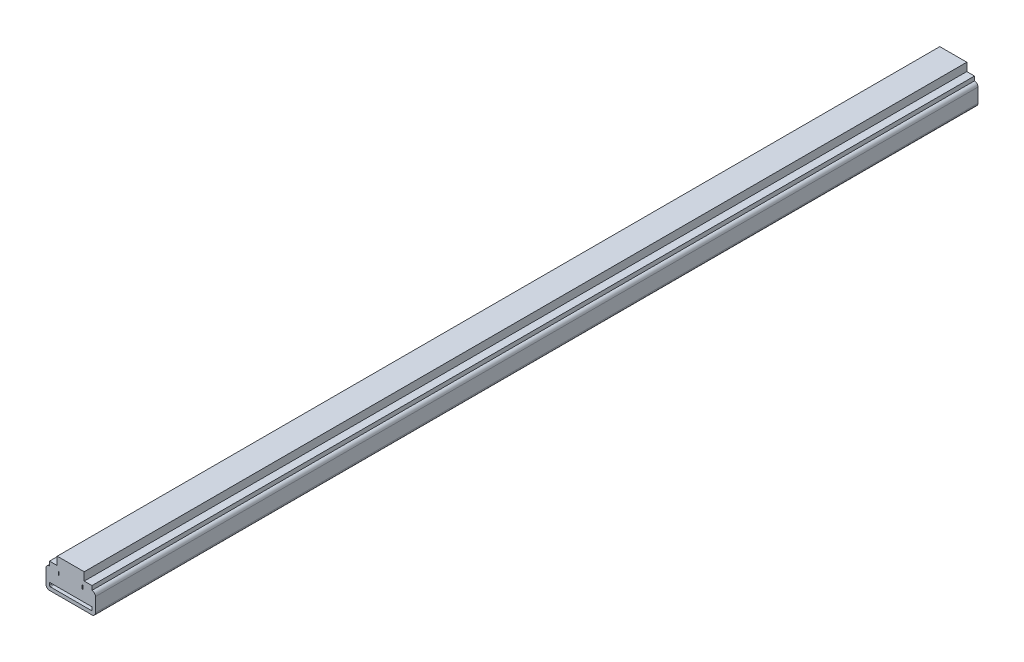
ISO-10303-21;
HEADER;
FILE_DESCRIPTION(('STEP AP214'),'2;1');
FILE_NAME('part.step','',(''),(''),'','','');
FILE_SCHEMA(('AUTOMOTIVE_DESIGN { 1 0 10303 214 1 1 1 1 }'));
ENDSEC;
DATA;
#1=APPLICATION_CONTEXT('core data for automotive mechanical design processes');
#2=APPLICATION_PROTOCOL_DEFINITION('international standard','automotive_design',2000,#1);
#3=PRODUCT_CONTEXT('',#1,'mechanical');
#4=PRODUCT('Part','Part','',(#3));
#5=PRODUCT_RELATED_PRODUCT_CATEGORY('part','',(#4));
#6=PRODUCT_DEFINITION_FORMATION('','',#4);
#7=PRODUCT_DEFINITION_CONTEXT('part definition',#1,'design');
#8=PRODUCT_DEFINITION('design','',#6,#7);
#9=PRODUCT_DEFINITION_SHAPE('','',#8);
#10=(LENGTH_UNIT() NAMED_UNIT(*) SI_UNIT(.MILLI.,.METRE.));
#11=(NAMED_UNIT(*) PLANE_ANGLE_UNIT() SI_UNIT($,.RADIAN.));
#12=(NAMED_UNIT(*) SI_UNIT($,.STERADIAN.) SOLID_ANGLE_UNIT());
#13=UNCERTAINTY_MEASURE_WITH_UNIT(LENGTH_MEASURE(1.E-05),#10,'distance_accuracy_value','');
#14=(GEOMETRIC_REPRESENTATION_CONTEXT(3) GLOBAL_UNCERTAINTY_ASSIGNED_CONTEXT((#13)) GLOBAL_UNIT_ASSIGNED_CONTEXT((#10,
#11,#12)) REPRESENTATION_CONTEXT('',''));
#15=CARTESIAN_POINT('',(0.,0.,0.));
#16=DIRECTION('',(0.,0.,1.));
#17=DIRECTION('',(1.,0.,0.));
#18=AXIS2_PLACEMENT_3D('',#15,#16,#17);
#19=CARTESIAN_POINT('',(12.000002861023,10.,0.));
#20=DIRECTION('',(0.,0.,1.));
#21=DIRECTION('',(1.,0.,0.));
#22=AXIS2_PLACEMENT_3D('',#19,#20,#21);
#23=PLANE('',#22);
#24=DIRECTION('',(0.,-1.,0.));
#25=VECTOR('',#24,1.);
#26=CARTESIAN_POINT('',(-6.5,12.,0.));
#27=LINE('',#26,#25);
#28=CARTESIAN_POINT('',(-6.5,12.,0.));
#29=VERTEX_POINT('',#28);
#30=CARTESIAN_POINT('',(-6.5,10.,0.));
#31=VERTEX_POINT('',#30);
#32=EDGE_CURVE('E204',#29,#31,#27,.T.);
#33=ORIENTED_EDGE('',*,*,#32,.F.);
#34=DIRECTION('',(-1.,0.,0.));
#35=VECTOR('',#34,1.);
#36=CARTESIAN_POINT('',(-6.5,12.,0.));
#37=LINE('',#36,#35);
#38=CARTESIAN_POINT('',(-7.,12.,0.));
#39=VERTEX_POINT('',#38);
#40=EDGE_CURVE('E201',#29,#39,#37,.T.);
#41=ORIENTED_EDGE('',*,*,#40,.T.);
#42=DIRECTION('',(0.,-1.,0.));
#43=VECTOR('',#42,1.);
#44=CARTESIAN_POINT('',(-7.,12.,0.));
#45=LINE('',#44,#43);
#46=CARTESIAN_POINT('',(-7.,10.,0.));
#47=VERTEX_POINT('',#46);
#48=EDGE_CURVE('E207',#39,#47,#45,.T.);
#49=ORIENTED_EDGE('',*,*,#48,.T.);
#50=DIRECTION('',(-1.,0.,0.));
#51=VECTOR('',#50,1.);
#52=CARTESIAN_POINT('',(-6.5,10.,0.));
#53=LINE('',#52,#51);
#54=EDGE_CURVE('E211',#31,#47,#53,.T.);
#55=ORIENTED_EDGE('',*,*,#54,.F.);
#56=EDGE_LOOP('',(#33,#41,#49,#55));
#57=FACE_BOUND('',#56,.T.);
#58=DIRECTION('',(-1.,0.,0.));
#59=VECTOR('',#58,1.);
#60=CARTESIAN_POINT('',(7.,12.,0.));
#61=LINE('',#60,#59);
#62=CARTESIAN_POINT('',(7.,12.,0.));
#63=VERTEX_POINT('',#62);
#64=CARTESIAN_POINT('',(6.5,12.,0.));
#65=VERTEX_POINT('',#64);
#66=EDGE_CURVE('E243',#63,#65,#61,.T.);
#67=ORIENTED_EDGE('',*,*,#66,.T.);
#68=DIRECTION('',(0.,-1.,0.));
#69=VECTOR('',#68,1.);
#70=CARTESIAN_POINT('',(6.5,12.,0.));
#71=LINE('',#70,#69);
#72=CARTESIAN_POINT('',(6.5,10.,0.));
#73=VERTEX_POINT('',#72);
#74=EDGE_CURVE('E233',#65,#73,#71,.T.);
#75=ORIENTED_EDGE('',*,*,#74,.T.);
#76=DIRECTION('',(1.,0.,0.));
#77=VECTOR('',#76,1.);
#78=CARTESIAN_POINT('',(6.5,10.,0.));
#79=LINE('',#78,#77);
#80=CARTESIAN_POINT('',(7.,10.,0.));
#81=VERTEX_POINT('',#80);
#82=EDGE_CURVE('E236',#73,#81,#79,.T.);
#83=ORIENTED_EDGE('',*,*,#82,.T.);
#84=DIRECTION('',(0.,-1.,0.));
#85=VECTOR('',#84,1.);
#86=CARTESIAN_POINT('',(7.,12.,0.));
#87=LINE('',#86,#85);
#88=EDGE_CURVE('E240',#63,#81,#87,.T.);
#89=ORIENTED_EDGE('',*,*,#88,.F.);
#90=EDGE_LOOP('',(#67,#75,#83,#89));
#91=FACE_BOUND('',#90,.T.);
#92=DIRECTION('',(0.,-1.,0.));
#93=VECTOR('',#92,1.);
#94=CARTESIAN_POINT('',(7.6499999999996,19.,0.));
#95=LINE('',#94,#93);
#96=CARTESIAN_POINT('',(7.6499999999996,19.,0.));
#97=VERTEX_POINT('',#96);
#98=CARTESIAN_POINT('',(7.6499999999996,14.4,0.));
#99=VERTEX_POINT('',#98);
#100=EDGE_CURVE('E312',#97,#99,#95,.T.);
#101=ORIENTED_EDGE('',*,*,#100,.T.);
#102=DIRECTION('',(1.,0.,0.));
#103=VECTOR('',#102,1.);
#104=CARTESIAN_POINT('',(7.6499999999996,14.4,0.));
#105=LINE('',#104,#103);
#106=CARTESIAN_POINT('',(12.,14.4,0.));
#107=VERTEX_POINT('',#106);
#108=EDGE_CURVE('E315',#99,#107,#105,.T.);
#109=ORIENTED_EDGE('',*,*,#108,.T.);
#110=DIRECTION('',(0.,-1.,0.));
#111=VECTOR('',#110,1.);
#112=CARTESIAN_POINT('',(12.,14.4,0.));
#113=LINE('',#112,#111);
#114=CARTESIAN_POINT('',(12.,12.0000028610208,0.));
#115=VERTEX_POINT('',#114);
#116=EDGE_CURVE('E318',#107,#115,#113,.T.);
#117=ORIENTED_EDGE('',*,*,#116,.T.);
#118=CARTESIAN_POINT('',(12.000002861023,10.,0.));
#119=DIRECTION('',(0.,0.,1.));
#120=DIRECTION('',(1.,0.,0.));
#121=AXIS2_PLACEMENT_3D('',#118,#119,#120);
#122=CIRCLE('',#121,2.00000286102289);
#123=CARTESIAN_POINT('',(14.0000057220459,10.,0.));
#124=VERTEX_POINT('',#123);
#125=EDGE_CURVE('E320',#124,#115,#122,.T.);
#126=ORIENTED_EDGE('',*,*,#125,.F.);
#127=DIRECTION('',(0.,-1.,0.));
#128=VECTOR('',#127,1.);
#129=CARTESIAN_POINT('',(14.0000057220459,10.,0.));
#130=LINE('',#129,#128);
#131=CARTESIAN_POINT('',(14.0000057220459,2.,0.));
#132=VERTEX_POINT('',#131);
#133=EDGE_CURVE('E323',#124,#132,#130,.T.);
#134=ORIENTED_EDGE('',*,*,#133,.T.);
#135=CARTESIAN_POINT('',(12.0000057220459,2.,0.));
#136=DIRECTION('',(0.,0.,1.));
#137=DIRECTION('',(1.,0.,0.));
#138=AXIS2_PLACEMENT_3D('',#135,#136,#137);
#139=CIRCLE('',#138,2.);
#140=CARTESIAN_POINT('',(12.0000057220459,0.,0.));
#141=VERTEX_POINT('',#140);
#142=EDGE_CURVE('E325',#141,#132,#139,.T.);
#143=ORIENTED_EDGE('',*,*,#142,.F.);
#144=DIRECTION('',(-1.,0.,0.));
#145=VECTOR('',#144,1.);
#146=CARTESIAN_POINT('',(12.0000057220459,0.,0.));
#147=LINE('',#146,#145);
#148=CARTESIAN_POINT('',(-12.000005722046,0.,0.));
#149=VERTEX_POINT('',#148);
#150=EDGE_CURVE('E328',#141,#149,#147,.T.);
#151=ORIENTED_EDGE('',*,*,#150,.T.);
#152=CARTESIAN_POINT('',(-12.000005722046,2.,0.));
#153=DIRECTION('',(0.,0.,1.));
#154=DIRECTION('',(1.,0.,0.));
#155=AXIS2_PLACEMENT_3D('',#152,#153,#154);
#156=CIRCLE('',#155,2.);
#157=CARTESIAN_POINT('',(-14.000005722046,2.,0.));
#158=VERTEX_POINT('',#157);
#159=EDGE_CURVE('E330',#158,#149,#156,.T.);
#160=ORIENTED_EDGE('',*,*,#159,.F.);
#161=DIRECTION('',(0.,-1.,0.));
#162=VECTOR('',#161,1.);
#163=CARTESIAN_POINT('',(-14.0000057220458,10.,0.));
#164=LINE('',#163,#162);
#165=CARTESIAN_POINT('',(-14.0000057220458,10.,0.));
#166=VERTEX_POINT('',#165);
#167=EDGE_CURVE('E333',#166,#158,#164,.T.);
#168=ORIENTED_EDGE('',*,*,#167,.F.);
#169=CARTESIAN_POINT('',(-12.0000057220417,10.0000000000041,0.));
#170=DIRECTION('',(0.,0.,1.));
#171=DIRECTION('',(1.,0.,0.));
#172=AXIS2_PLACEMENT_3D('',#169,#170,#171);
#173=CIRCLE('',#172,2.00000000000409);
#174=CARTESIAN_POINT('',(-12.,12.,0.));
#175=VERTEX_POINT('',#174);
#176=EDGE_CURVE('E336',#175,#166,#173,.T.);
#177=ORIENTED_EDGE('',*,*,#176,.F.);
#178=DIRECTION('',(0.,-1.,0.));
#179=VECTOR('',#178,1.);
#180=CARTESIAN_POINT('',(-12.,14.4,0.));
#181=LINE('',#180,#179);
#182=CARTESIAN_POINT('',(-12.,14.4,0.));
#183=VERTEX_POINT('',#182);
#184=EDGE_CURVE('E339',#183,#175,#181,.T.);
#185=ORIENTED_EDGE('',*,*,#184,.F.);
#186=DIRECTION('',(-1.,0.,0.));
#187=VECTOR('',#186,1.);
#188=CARTESIAN_POINT('',(-7.64999999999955,14.4,0.));
#189=LINE('',#188,#187);
#190=CARTESIAN_POINT('',(-7.64999999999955,14.4,0.));
#191=VERTEX_POINT('',#190);
#192=EDGE_CURVE('E342',#191,#183,#189,.T.);
#193=ORIENTED_EDGE('',*,*,#192,.F.);
#194=DIRECTION('',(0.,-1.,0.));
#195=VECTOR('',#194,1.);
#196=CARTESIAN_POINT('',(-7.64999999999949,19.,0.));
#197=LINE('',#196,#195);
#198=CARTESIAN_POINT('',(-7.64999999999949,19.,0.));
#199=VERTEX_POINT('',#198);
#200=EDGE_CURVE('E345',#199,#191,#197,.T.);
#201=ORIENTED_EDGE('',*,*,#200,.F.);
#202=DIRECTION('',(-1.,0.,0.));
#203=VECTOR('',#202,1.);
#204=CARTESIAN_POINT('',(7.6499999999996,19.,0.));
#205=LINE('',#204,#203);
#206=EDGE_CURVE('E348',#97,#199,#205,.T.);
#207=ORIENTED_EDGE('',*,*,#206,.F.);
#208=EDGE_LOOP('',(#101,#109,#117,#126,#134,#143,#151,#160,#168,#177,#185,#193,#201,#207));
#209=FACE_BOUND('',#208,.T.);
#210=DIRECTION('',(0.,-1.,0.));
#211=VECTOR('',#210,1.);
#212=CARTESIAN_POINT('',(12.,4.00000000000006,0.));
#213=LINE('',#212,#211);
#214=CARTESIAN_POINT('',(12.,4.00000000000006,0.));
#215=VERTEX_POINT('',#214);
#216=CARTESIAN_POINT('',(12.,2.5,0.));
#217=VERTEX_POINT('',#216);
#218=EDGE_CURVE('E265',#215,#217,#213,.T.);
#219=ORIENTED_EDGE('',*,*,#218,.F.);
#220=DIRECTION('',(-1.,0.,0.));
#221=VECTOR('',#220,1.);
#222=CARTESIAN_POINT('',(12.,4.00000000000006,0.));
#223=LINE('',#222,#221);
#224=CARTESIAN_POINT('',(-12.,4.00000000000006,0.));
#225=VERTEX_POINT('',#224);
#226=EDGE_CURVE('E279',#215,#225,#223,.T.);
#227=ORIENTED_EDGE('',*,*,#226,.T.);
#228=DIRECTION('',(0.,-1.,0.));
#229=VECTOR('',#228,1.);
#230=CARTESIAN_POINT('',(-12.,4.00000000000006,0.));
#231=LINE('',#230,#229);
#232=CARTESIAN_POINT('',(-12.,2.5,0.));
#233=VERTEX_POINT('',#232);
#234=EDGE_CURVE('E276',#225,#233,#231,.T.);
#235=ORIENTED_EDGE('',*,*,#234,.T.);
#236=CARTESIAN_POINT('',(-11.5,2.5,0.));
#237=DIRECTION('',(0.,0.,1.));
#238=DIRECTION('',(1.,0.,0.));
#239=AXIS2_PLACEMENT_3D('',#236,#237,#238);
#240=CIRCLE('',#239,0.5);
#241=CARTESIAN_POINT('',(-11.5,2.,0.));
#242=VERTEX_POINT('',#241);
#243=EDGE_CURVE('E273',#233,#242,#240,.T.);
#244=ORIENTED_EDGE('',*,*,#243,.T.);
#245=DIRECTION('',(-1.,0.,0.));
#246=VECTOR('',#245,1.);
#247=CARTESIAN_POINT('',(11.5,2.,0.));
#248=LINE('',#247,#246);
#249=CARTESIAN_POINT('',(11.5,2.,0.));
#250=VERTEX_POINT('',#249);
#251=EDGE_CURVE('E271',#250,#242,#248,.T.);
#252=ORIENTED_EDGE('',*,*,#251,.F.);
#253=CARTESIAN_POINT('',(11.5,2.5,0.));
#254=DIRECTION('',(0.,0.,1.));
#255=DIRECTION('',(1.,0.,0.));
#256=AXIS2_PLACEMENT_3D('',#253,#254,#255);
#257=CIRCLE('',#256,0.5);
#258=EDGE_CURVE('E267',#250,#217,#257,.T.);
#259=ORIENTED_EDGE('',*,*,#258,.T.);
#260=EDGE_LOOP('',(#219,#227,#235,#244,#252,#259));
#261=FACE_BOUND('',#260,.T.);
#262=ADVANCED_FACE('F14',(#57,#91,#209,#261),#23,.F.);
#263=CARTESIAN_POINT('',(12.000002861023,10.,500.));
#264=DIRECTION('',(0.,0.,1.));
#265=DIRECTION('',(1.,0.,0.));
#266=AXIS2_PLACEMENT_3D('',#263,#264,#265);
#267=PLANE('',#266);
#268=DIRECTION('',(-1.,0.,0.));
#269=VECTOR('',#268,1.);
#270=CARTESIAN_POINT('',(-6.5,12.,500.));
#271=LINE('',#270,#269);
#272=CARTESIAN_POINT('',(-6.5,12.,500.));
#273=VERTEX_POINT('',#272);
#274=CARTESIAN_POINT('',(-7.,12.,500.));
#275=VERTEX_POINT('',#274);
#276=EDGE_CURVE('E37',#273,#275,#271,.T.);
#277=ORIENTED_EDGE('',*,*,#276,.F.);
#278=DIRECTION('',(0.,-1.,0.));
#279=VECTOR('',#278,1.);
#280=CARTESIAN_POINT('',(-6.5,12.,500.));
#281=LINE('',#280,#279);
#282=CARTESIAN_POINT('',(-6.5,10.,500.));
#283=VERTEX_POINT('',#282);
#284=EDGE_CURVE('E214',#273,#283,#281,.T.);
#285=ORIENTED_EDGE('',*,*,#284,.T.);
#286=DIRECTION('',(-1.,0.,0.));
#287=VECTOR('',#286,1.);
#288=CARTESIAN_POINT('',(-6.5,10.,500.));
#289=LINE('',#288,#287);
#290=CARTESIAN_POINT('',(-7.,10.,500.));
#291=VERTEX_POINT('',#290);
#292=EDGE_CURVE('E217',#283,#291,#289,.T.);
#293=ORIENTED_EDGE('',*,*,#292,.T.);
#294=DIRECTION('',(0.,-1.,0.));
#295=VECTOR('',#294,1.);
#296=CARTESIAN_POINT('',(-7.,12.,500.));
#297=LINE('',#296,#295);
#298=EDGE_CURVE('E223',#275,#291,#297,.T.);
#299=ORIENTED_EDGE('',*,*,#298,.F.);
#300=EDGE_LOOP('',(#277,#285,#293,#299));
#301=FACE_BOUND('',#300,.T.);
#302=DIRECTION('',(0.,-1.,0.));
#303=VECTOR('',#302,1.);
#304=CARTESIAN_POINT('',(6.5,12.,500.));
#305=LINE('',#304,#303);
#306=CARTESIAN_POINT('',(6.5,12.,500.));
#307=VERTEX_POINT('',#306);
#308=CARTESIAN_POINT('',(6.5,10.,500.));
#309=VERTEX_POINT('',#308);
#310=EDGE_CURVE('E229',#307,#309,#305,.T.);
#311=ORIENTED_EDGE('',*,*,#310,.F.);
#312=DIRECTION('',(-1.,0.,0.));
#313=VECTOR('',#312,1.);
#314=CARTESIAN_POINT('',(7.,12.,500.));
#315=LINE('',#314,#313);
#316=CARTESIAN_POINT('',(7.,12.,500.));
#317=VERTEX_POINT('',#316);
#318=EDGE_CURVE('E237',#317,#307,#315,.T.);
#319=ORIENTED_EDGE('',*,*,#318,.F.);
#320=DIRECTION('',(0.,-1.,0.));
#321=VECTOR('',#320,1.);
#322=CARTESIAN_POINT('',(7.,12.,500.));
#323=LINE('',#322,#321);
#324=CARTESIAN_POINT('',(7.,10.,500.));
#325=VERTEX_POINT('',#324);
#326=EDGE_CURVE('E251',#317,#325,#323,.T.);
#327=ORIENTED_EDGE('',*,*,#326,.T.);
#328=DIRECTION('',(1.,0.,0.));
#329=VECTOR('',#328,1.);
#330=CARTESIAN_POINT('',(6.5,10.,500.));
#331=LINE('',#330,#329);
#332=EDGE_CURVE('E248',#309,#325,#331,.T.);
#333=ORIENTED_EDGE('',*,*,#332,.F.);
#334=EDGE_LOOP('',(#311,#319,#327,#333));
#335=FACE_BOUND('',#334,.T.);
#336=DIRECTION('',(0.,-1.,0.));
#337=VECTOR('',#336,1.);
#338=CARTESIAN_POINT('',(7.6499999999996,19.,500.));
#339=LINE('',#338,#337);
#340=CARTESIAN_POINT('',(7.6499999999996,19.,500.));
#341=VERTEX_POINT('',#340);
#342=CARTESIAN_POINT('',(7.6499999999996,14.4,500.));
#343=VERTEX_POINT('',#342);
#344=EDGE_CURVE('E311',#341,#343,#339,.T.);
#345=ORIENTED_EDGE('',*,*,#344,.F.);
#346=DIRECTION('',(-1.,0.,0.));
#347=VECTOR('',#346,1.);
#348=CARTESIAN_POINT('',(7.6499999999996,19.,500.));
#349=LINE('',#348,#347);
#350=CARTESIAN_POINT('',(-7.64999999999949,19.,500.));
#351=VERTEX_POINT('',#350);
#352=EDGE_CURVE('E316',#341,#351,#349,.T.);
#353=ORIENTED_EDGE('',*,*,#352,.T.);
#354=DIRECTION('',(0.,-1.,0.));
#355=VECTOR('',#354,1.);
#356=CARTESIAN_POINT('',(-7.64999999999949,19.,500.));
#357=LINE('',#356,#355);
#358=CARTESIAN_POINT('',(-7.64999999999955,14.4,500.));
#359=VERTEX_POINT('',#358);
#360=EDGE_CURVE('E386',#351,#359,#357,.T.);
#361=ORIENTED_EDGE('',*,*,#360,.T.);
#362=DIRECTION('',(-1.,0.,0.));
#363=VECTOR('',#362,1.);
#364=CARTESIAN_POINT('',(-7.64999999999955,14.4,500.));
#365=LINE('',#364,#363);
#366=CARTESIAN_POINT('',(-12.,14.4,500.));
#367=VERTEX_POINT('',#366);
#368=EDGE_CURVE('E383',#359,#367,#365,.T.);
#369=ORIENTED_EDGE('',*,*,#368,.T.);
#370=DIRECTION('',(0.,-1.,0.));
#371=VECTOR('',#370,1.);
#372=CARTESIAN_POINT('',(-12.,14.4,500.));
#373=LINE('',#372,#371);
#374=CARTESIAN_POINT('',(-12.,12.,500.));
#375=VERTEX_POINT('',#374);
#376=EDGE_CURVE('E380',#367,#375,#373,.T.);
#377=ORIENTED_EDGE('',*,*,#376,.T.);
#378=CARTESIAN_POINT('',(-12.0000057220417,10.0000000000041,500.));
#379=DIRECTION('',(0.,0.,1.));
#380=DIRECTION('',(1.,0.,0.));
#381=AXIS2_PLACEMENT_3D('',#378,#379,#380);
#382=CIRCLE('',#381,2.00000000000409);
#383=CARTESIAN_POINT('',(-14.0000057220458,10.,500.));
#384=VERTEX_POINT('',#383);
#385=EDGE_CURVE('E377',#375,#384,#382,.T.);
#386=ORIENTED_EDGE('',*,*,#385,.T.);
#387=DIRECTION('',(0.,-1.,0.));
#388=VECTOR('',#387,1.);
#389=CARTESIAN_POINT('',(-14.0000057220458,10.,500.));
#390=LINE('',#389,#388);
#391=CARTESIAN_POINT('',(-14.000005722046,2.,500.));
#392=VERTEX_POINT('',#391);
#393=EDGE_CURVE('E374',#384,#392,#390,.T.);
#394=ORIENTED_EDGE('',*,*,#393,.T.);
#395=CARTESIAN_POINT('',(-12.000005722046,2.,500.));
#396=DIRECTION('',(0.,0.,1.));
#397=DIRECTION('',(1.,0.,0.));
#398=AXIS2_PLACEMENT_3D('',#395,#396,#397);
#399=CIRCLE('',#398,2.);
#400=CARTESIAN_POINT('',(-12.000005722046,0.,500.));
#401=VERTEX_POINT('',#400);
#402=EDGE_CURVE('E371',#392,#401,#399,.T.);
#403=ORIENTED_EDGE('',*,*,#402,.T.);
#404=DIRECTION('',(-1.,0.,0.));
#405=VECTOR('',#404,1.);
#406=CARTESIAN_POINT('',(12.0000057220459,0.,500.));
#407=LINE('',#406,#405);
#408=CARTESIAN_POINT('',(12.0000057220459,0.,500.));
#409=VERTEX_POINT('',#408);
#410=EDGE_CURVE('E368',#409,#401,#407,.T.);
#411=ORIENTED_EDGE('',*,*,#410,.F.);
#412=CARTESIAN_POINT('',(12.0000057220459,2.,500.));
#413=DIRECTION('',(0.,0.,1.));
#414=DIRECTION('',(1.,0.,0.));
#415=AXIS2_PLACEMENT_3D('',#412,#413,#414);
#416=CIRCLE('',#415,2.);
#417=CARTESIAN_POINT('',(14.0000057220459,2.,500.));
#418=VERTEX_POINT('',#417);
#419=EDGE_CURVE('E365',#409,#418,#416,.T.);
#420=ORIENTED_EDGE('',*,*,#419,.T.);
#421=DIRECTION('',(0.,-1.,0.));
#422=VECTOR('',#421,1.);
#423=CARTESIAN_POINT('',(14.0000057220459,10.,500.));
#424=LINE('',#423,#422);
#425=CARTESIAN_POINT('',(14.0000057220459,10.,500.));
#426=VERTEX_POINT('',#425);
#427=EDGE_CURVE('E362',#426,#418,#424,.T.);
#428=ORIENTED_EDGE('',*,*,#427,.F.);
#429=CARTESIAN_POINT('',(12.000002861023,10.,500.));
#430=DIRECTION('',(0.,0.,1.));
#431=DIRECTION('',(1.,0.,0.));
#432=AXIS2_PLACEMENT_3D('',#429,#430,#431);
#433=CIRCLE('',#432,2.00000286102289);
#434=CARTESIAN_POINT('',(12.,12.0000028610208,500.));
#435=VERTEX_POINT('',#434);
#436=EDGE_CURVE('E359',#426,#435,#433,.T.);
#437=ORIENTED_EDGE('',*,*,#436,.T.);
#438=DIRECTION('',(0.,-1.,0.));
#439=VECTOR('',#438,1.);
#440=CARTESIAN_POINT('',(12.,14.4,500.));
#441=LINE('',#440,#439);
#442=CARTESIAN_POINT('',(12.,14.4,500.));
#443=VERTEX_POINT('',#442);
#444=EDGE_CURVE('E356',#443,#435,#441,.T.);
#445=ORIENTED_EDGE('',*,*,#444,.F.);
#446=DIRECTION('',(1.,0.,0.));
#447=VECTOR('',#446,1.);
#448=CARTESIAN_POINT('',(7.6499999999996,14.4,500.));
#449=LINE('',#448,#447);
#450=EDGE_CURVE('E354',#343,#443,#449,.T.);
#451=ORIENTED_EDGE('',*,*,#450,.F.);
#452=EDGE_LOOP('',(#345,#353,#361,#369,#377,#386,#394,#403,#411,#420,#428,#437,#445,#451));
#453=FACE_BOUND('',#452,.T.);
#454=DIRECTION('',(-1.,0.,0.));
#455=VECTOR('',#454,1.);
#456=CARTESIAN_POINT('',(12.,4.00000000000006,500.));
#457=LINE('',#456,#455);
#458=CARTESIAN_POINT('',(12.,4.00000000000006,500.));
#459=VERTEX_POINT('',#458);
#460=CARTESIAN_POINT('',(-12.,4.00000000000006,500.));
#461=VERTEX_POINT('',#460);
#462=EDGE_CURVE('E268',#459,#461,#457,.T.);
#463=ORIENTED_EDGE('',*,*,#462,.F.);
#464=DIRECTION('',(0.,-1.,0.));
#465=VECTOR('',#464,1.);
#466=CARTESIAN_POINT('',(12.,4.00000000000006,500.));
#467=LINE('',#466,#465);
#468=CARTESIAN_POINT('',(12.,2.5,500.));
#469=VERTEX_POINT('',#468);
#470=EDGE_CURVE('E258',#459,#469,#467,.T.);
#471=ORIENTED_EDGE('',*,*,#470,.T.);
#472=CARTESIAN_POINT('',(11.5,2.5,500.));
#473=DIRECTION('',(0.,0.,1.));
#474=DIRECTION('',(1.,0.,0.));
#475=AXIS2_PLACEMENT_3D('',#472,#473,#474);
#476=CIRCLE('',#475,0.5);
#477=CARTESIAN_POINT('',(11.5,2.,500.));
#478=VERTEX_POINT('',#477);
#479=EDGE_CURVE('E285',#478,#469,#476,.T.);
#480=ORIENTED_EDGE('',*,*,#479,.F.);
#481=DIRECTION('',(-1.,0.,0.));
#482=VECTOR('',#481,1.);
#483=CARTESIAN_POINT('',(11.5,2.,500.));
#484=LINE('',#483,#482);
#485=CARTESIAN_POINT('',(-11.5,2.,500.));
#486=VERTEX_POINT('',#485);
#487=EDGE_CURVE('E288',#478,#486,#484,.T.);
#488=ORIENTED_EDGE('',*,*,#487,.T.);
#489=CARTESIAN_POINT('',(-11.5,2.5,500.));
#490=DIRECTION('',(0.,0.,1.));
#491=DIRECTION('',(1.,0.,0.));
#492=AXIS2_PLACEMENT_3D('',#489,#490,#491);
#493=CIRCLE('',#492,0.5);
#494=CARTESIAN_POINT('',(-12.,2.5,500.));
#495=VERTEX_POINT('',#494);
#496=EDGE_CURVE('E291',#495,#486,#493,.T.);
#497=ORIENTED_EDGE('',*,*,#496,.F.);
#498=DIRECTION('',(0.,-1.,0.));
#499=VECTOR('',#498,1.);
#500=CARTESIAN_POINT('',(-12.,4.00000000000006,500.));
#501=LINE('',#500,#499);
#502=EDGE_CURVE('E294',#461,#495,#501,.T.);
#503=ORIENTED_EDGE('',*,*,#502,.F.);
#504=EDGE_LOOP('',(#463,#471,#480,#488,#497,#503));
#505=FACE_BOUND('',#504,.T.);
#506=ADVANCED_FACE('F423',(#301,#335,#453,#505),#267,.T.);
#507=CARTESIAN_POINT('',(7.6499999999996,19.,0.));
#508=DIRECTION('',(-1.,0.,0.));
#509=DIRECTION('',(0.,0.,1.));
#510=AXIS2_PLACEMENT_3D('',#507,#508,#509);
#511=PLANE('',#510);
#512=ORIENTED_EDGE('',*,*,#344,.T.);
#513=DIRECTION('',(0.,0.,1.));
#514=VECTOR('',#513,1.);
#515=CARTESIAN_POINT('',(7.6499999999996,14.4,0.));
#516=LINE('',#515,#514);
#517=EDGE_CURVE('E9',#99,#343,#516,.T.);
#518=ORIENTED_EDGE('',*,*,#517,.F.);
#519=ORIENTED_EDGE('',*,*,#100,.F.);
#520=DIRECTION('',(0.,0.,1.));
#521=VECTOR('',#520,1.);
#522=CARTESIAN_POINT('',(7.6499999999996,19.,0.));
#523=LINE('',#522,#521);
#524=EDGE_CURVE('E351',#97,#341,#523,.T.);
#525=ORIENTED_EDGE('',*,*,#524,.T.);
#526=EDGE_LOOP('',(#512,#518,#519,#525));
#527=FACE_BOUND('',#526,.T.);
#528=ADVANCED_FACE('F16',(#527),#511,.F.);
#529=CARTESIAN_POINT('',(7.6499999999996,14.4,0.));
#530=DIRECTION('',(0.,-1.,0.));
#531=DIRECTION('',(1.,0.,0.));
#532=AXIS2_PLACEMENT_3D('',#529,#530,#531);
#533=PLANE('',#532);
#534=ORIENTED_EDGE('',*,*,#450,.T.);
#535=DIRECTION('',(0.,0.,1.));
#536=VECTOR('',#535,1.);
#537=CARTESIAN_POINT('',(12.,14.4,0.));
#538=LINE('',#537,#536);
#539=EDGE_CURVE('E22',#107,#443,#538,.T.);
#540=ORIENTED_EDGE('',*,*,#539,.F.);
#541=ORIENTED_EDGE('',*,*,#108,.F.);
#542=ORIENTED_EDGE('',*,*,#517,.T.);
#543=EDGE_LOOP('',(#534,#540,#541,#542));
#544=FACE_BOUND('',#543,.T.);
#545=ADVANCED_FACE('F438',(#544),#533,.F.);
#546=CARTESIAN_POINT('',(12.,14.4,0.));
#547=DIRECTION('',(-1.,0.,0.));
#548=DIRECTION('',(0.,-1.,0.));
#549=AXIS2_PLACEMENT_3D('',#546,#547,#548);
#550=PLANE('',#549);
#551=ORIENTED_EDGE('',*,*,#444,.T.);
#552=DIRECTION('',(0.,0.,1.));
#553=VECTOR('',#552,1.);
#554=CARTESIAN_POINT('',(12.,12.0000028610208,0.));
#555=LINE('',#554,#553);
#556=EDGE_CURVE('E412',#115,#435,#555,.T.);
#557=ORIENTED_EDGE('',*,*,#556,.F.);
#558=ORIENTED_EDGE('',*,*,#116,.F.);
#559=ORIENTED_EDGE('',*,*,#539,.T.);
#560=EDGE_LOOP('',(#551,#557,#558,#559));
#561=FACE_BOUND('',#560,.T.);
#562=ADVANCED_FACE('F418',(#561),#550,.F.);
#563=CARTESIAN_POINT('',(12.000002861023,10.,0.));
#564=DIRECTION('',(0.,0.,1.));
#565=DIRECTION('',(1.,0.,0.));
#566=AXIS2_PLACEMENT_3D('',#563,#564,#565);
#567=CYLINDRICAL_SURFACE('',#566,2.00000286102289);
#568=ORIENTED_EDGE('',*,*,#436,.F.);
#569=DIRECTION('',(0.,0.,1.));
#570=VECTOR('',#569,1.);
#571=CARTESIAN_POINT('',(14.0000057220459,10.,0.));
#572=LINE('',#571,#570);
#573=EDGE_CURVE('E410',#124,#426,#572,.T.);
#574=ORIENTED_EDGE('',*,*,#573,.F.);
#575=ORIENTED_EDGE('',*,*,#125,.T.);
#576=ORIENTED_EDGE('',*,*,#556,.T.);
#577=EDGE_LOOP('',(#568,#574,#575,#576));
#578=FACE_BOUND('',#577,.T.);
#579=ADVANCED_FACE('F428',(#578),#567,.T.);
#580=CARTESIAN_POINT('',(14.0000057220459,10.,0.));
#581=DIRECTION('',(-1.,0.,0.));
#582=DIRECTION('',(0.,0.,1.));
#583=AXIS2_PLACEMENT_3D('',#580,#581,#582);
#584=PLANE('',#583);
#585=ORIENTED_EDGE('',*,*,#427,.T.);
#586=DIRECTION('',(0.,0.,1.));
#587=VECTOR('',#586,1.);
#588=CARTESIAN_POINT('',(14.0000057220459,2.,0.));
#589=LINE('',#588,#587);
#590=EDGE_CURVE('E408',#132,#418,#589,.T.);
#591=ORIENTED_EDGE('',*,*,#590,.F.);
#592=ORIENTED_EDGE('',*,*,#133,.F.);
#593=ORIENTED_EDGE('',*,*,#573,.T.);
#594=EDGE_LOOP('',(#585,#591,#592,#593));
#595=FACE_BOUND('',#594,.T.);
#596=ADVANCED_FACE('F476',(#595),#584,.F.);
#597=CARTESIAN_POINT('',(12.0000057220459,2.,0.));
#598=DIRECTION('',(0.,0.,1.));
#599=DIRECTION('',(1.,0.,0.));
#600=AXIS2_PLACEMENT_3D('',#597,#598,#599);
#601=CYLINDRICAL_SURFACE('',#600,2.);
#602=ORIENTED_EDGE('',*,*,#419,.F.);
#603=DIRECTION('',(0.,0.,1.));
#604=VECTOR('',#603,1.);
#605=CARTESIAN_POINT('',(12.0000057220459,0.,0.));
#606=LINE('',#605,#604);
#607=EDGE_CURVE('E406',#141,#409,#606,.T.);
#608=ORIENTED_EDGE('',*,*,#607,.F.);
#609=ORIENTED_EDGE('',*,*,#142,.T.);
#610=ORIENTED_EDGE('',*,*,#590,.T.);
#611=EDGE_LOOP('',(#602,#608,#609,#610));
#612=FACE_BOUND('',#611,.T.);
#613=ADVANCED_FACE('F474',(#612),#601,.T.);
#614=CARTESIAN_POINT('',(12.0000057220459,0.,0.));
#615=DIRECTION('',(0.,1.,0.));
#616=DIRECTION('',(-1.,0.,0.));
#617=AXIS2_PLACEMENT_3D('',#614,#615,#616);
#618=PLANE('',#617);
#619=ORIENTED_EDGE('',*,*,#410,.T.);
#620=DIRECTION('',(0.,0.,1.));
#621=VECTOR('',#620,1.);
#622=CARTESIAN_POINT('',(-12.000005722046,0.,0.));
#623=LINE('',#622,#621);
#624=EDGE_CURVE('E404',#149,#401,#623,.T.);
#625=ORIENTED_EDGE('',*,*,#624,.F.);
#626=ORIENTED_EDGE('',*,*,#150,.F.);
#627=ORIENTED_EDGE('',*,*,#607,.T.);
#628=EDGE_LOOP('',(#619,#625,#626,#627));
#629=FACE_BOUND('',#628,.T.);
#630=ADVANCED_FACE('F471',(#629),#618,.F.);
#631=CARTESIAN_POINT('',(-12.000005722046,2.,0.));
#632=DIRECTION('',(0.,0.,1.));
#633=DIRECTION('',(1.,0.,0.));
#634=AXIS2_PLACEMENT_3D('',#631,#632,#633);
#635=CYLINDRICAL_SURFACE('',#634,2.);
#636=ORIENTED_EDGE('',*,*,#402,.F.);
#637=DIRECTION('',(0.,0.,1.));
#638=VECTOR('',#637,1.);
#639=CARTESIAN_POINT('',(-14.000005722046,2.,0.));
#640=LINE('',#639,#638);
#641=EDGE_CURVE('E402',#158,#392,#640,.T.);
#642=ORIENTED_EDGE('',*,*,#641,.F.);
#643=ORIENTED_EDGE('',*,*,#159,.T.);
#644=ORIENTED_EDGE('',*,*,#624,.T.);
#645=EDGE_LOOP('',(#636,#642,#643,#644));
#646=FACE_BOUND('',#645,.T.);
#647=ADVANCED_FACE('F467',(#646),#635,.T.);
#648=CARTESIAN_POINT('',(-14.0000057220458,10.,0.));
#649=DIRECTION('',(-1.,0.,0.));
#650=DIRECTION('',(0.,-1.,0.));
#651=AXIS2_PLACEMENT_3D('',#648,#649,#650);
#652=PLANE('',#651);
#653=ORIENTED_EDGE('',*,*,#393,.F.);
#654=DIRECTION('',(0.,0.,1.));
#655=VECTOR('',#654,1.);
#656=CARTESIAN_POINT('',(-14.0000057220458,10.,0.));
#657=LINE('',#656,#655);
#658=EDGE_CURVE('E400',#166,#384,#657,.T.);
#659=ORIENTED_EDGE('',*,*,#658,.F.);
#660=ORIENTED_EDGE('',*,*,#167,.T.);
#661=ORIENTED_EDGE('',*,*,#641,.T.);
#662=EDGE_LOOP('',(#653,#659,#660,#661));
#663=FACE_BOUND('',#662,.T.);
#664=ADVANCED_FACE('F463',(#663),#652,.T.);
#665=CARTESIAN_POINT('',(-12.0000057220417,10.0000000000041,0.));
#666=DIRECTION('',(0.,0.,1.));
#667=DIRECTION('',(1.,0.,0.));
#668=AXIS2_PLACEMENT_3D('',#665,#666,#667);
#669=CYLINDRICAL_SURFACE('',#668,2.00000000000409);
#670=ORIENTED_EDGE('',*,*,#385,.F.);
#671=DIRECTION('',(0.,0.,1.));
#672=VECTOR('',#671,1.);
#673=CARTESIAN_POINT('',(-12.,12.,0.));
#674=LINE('',#673,#672);
#675=EDGE_CURVE('E398',#175,#375,#674,.T.);
#676=ORIENTED_EDGE('',*,*,#675,.F.);
#677=ORIENTED_EDGE('',*,*,#176,.T.);
#678=ORIENTED_EDGE('',*,*,#658,.T.);
#679=EDGE_LOOP('',(#670,#676,#677,#678));
#680=FACE_BOUND('',#679,.T.);
#681=ADVANCED_FACE('F458',(#680),#669,.T.);
#682=CARTESIAN_POINT('',(-12.,14.4,0.));
#683=DIRECTION('',(-1.,0.,0.));
#684=DIRECTION('',(0.,0.,1.));
#685=AXIS2_PLACEMENT_3D('',#682,#683,#684);
#686=PLANE('',#685);
#687=ORIENTED_EDGE('',*,*,#376,.F.);
#688=DIRECTION('',(0.,0.,1.));
#689=VECTOR('',#688,1.);
#690=CARTESIAN_POINT('',(-12.,14.4,0.));
#691=LINE('',#690,#689);
#692=EDGE_CURVE('E396',#183,#367,#691,.T.);
#693=ORIENTED_EDGE('',*,*,#692,.F.);
#694=ORIENTED_EDGE('',*,*,#184,.T.);
#695=ORIENTED_EDGE('',*,*,#675,.T.);
#696=EDGE_LOOP('',(#687,#693,#694,#695));
#697=FACE_BOUND('',#696,.T.);
#698=ADVANCED_FACE('F454',(#697),#686,.T.);
#699=CARTESIAN_POINT('',(-7.64999999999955,14.4,0.));
#700=DIRECTION('',(0.,1.,0.));
#701=DIRECTION('',(-1.,0.,0.));
#702=AXIS2_PLACEMENT_3D('',#699,#700,#701);
#703=PLANE('',#702);
#704=ORIENTED_EDGE('',*,*,#368,.F.);
#705=DIRECTION('',(0.,0.,1.));
#706=VECTOR('',#705,1.);
#707=CARTESIAN_POINT('',(-7.64999999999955,14.4,0.));
#708=LINE('',#707,#706);
#709=EDGE_CURVE('E394',#191,#359,#708,.T.);
#710=ORIENTED_EDGE('',*,*,#709,.F.);
#711=ORIENTED_EDGE('',*,*,#192,.T.);
#712=ORIENTED_EDGE('',*,*,#692,.T.);
#713=EDGE_LOOP('',(#704,#710,#711,#712));
#714=FACE_BOUND('',#713,.T.);
#715=ADVANCED_FACE('F450',(#714),#703,.T.);
#716=CARTESIAN_POINT('',(-7.64999999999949,19.,0.));
#717=DIRECTION('',(-1.,0.,0.));
#718=DIRECTION('',(0.,-1.,0.));
#719=AXIS2_PLACEMENT_3D('',#716,#717,#718);
#720=PLANE('',#719);
#721=ORIENTED_EDGE('',*,*,#360,.F.);
#722=DIRECTION('',(0.,0.,1.));
#723=VECTOR('',#722,1.);
#724=CARTESIAN_POINT('',(-7.64999999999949,19.,0.));
#725=LINE('',#724,#723);
#726=EDGE_CURVE('E392',#199,#351,#725,.T.);
#727=ORIENTED_EDGE('',*,*,#726,.F.);
#728=ORIENTED_EDGE('',*,*,#200,.T.);
#729=ORIENTED_EDGE('',*,*,#709,.T.);
#730=EDGE_LOOP('',(#721,#727,#728,#729));
#731=FACE_BOUND('',#730,.T.);
#732=ADVANCED_FACE('F446',(#731),#720,.T.);
#733=CARTESIAN_POINT('',(7.6499999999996,19.,0.));
#734=DIRECTION('',(0.,1.,0.));
#735=DIRECTION('',(-1.,0.,0.));
#736=AXIS2_PLACEMENT_3D('',#733,#734,#735);
#737=PLANE('',#736);
#738=ORIENTED_EDGE('',*,*,#352,.F.);
#739=ORIENTED_EDGE('',*,*,#524,.F.);
#740=ORIENTED_EDGE('',*,*,#206,.T.);
#741=ORIENTED_EDGE('',*,*,#726,.T.);
#742=EDGE_LOOP('',(#738,#739,#740,#741));
#743=FACE_BOUND('',#742,.T.);
#744=ADVANCED_FACE('F442',(#743),#737,.T.);
#745=CARTESIAN_POINT('',(12.,4.00000000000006,0.));
#746=DIRECTION('',(-1.,0.,0.));
#747=DIRECTION('',(0.,0.,1.));
#748=AXIS2_PLACEMENT_3D('',#745,#746,#747);
#749=PLANE('',#748);
#750=ORIENTED_EDGE('',*,*,#470,.F.);
#751=DIRECTION('',(0.,0.,1.));
#752=VECTOR('',#751,1.);
#753=CARTESIAN_POINT('',(12.,4.00000000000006,0.));
#754=LINE('',#753,#752);
#755=EDGE_CURVE('E282',#215,#459,#754,.T.);
#756=ORIENTED_EDGE('',*,*,#755,.F.);
#757=ORIENTED_EDGE('',*,*,#218,.T.);
#758=DIRECTION('',(0.,0.,1.));
#759=VECTOR('',#758,1.);
#760=CARTESIAN_POINT('',(12.,2.5,0.));
#761=LINE('',#760,#759);
#762=EDGE_CURVE('E309',#217,#469,#761,.T.);
#763=ORIENTED_EDGE('',*,*,#762,.T.);
#764=EDGE_LOOP('',(#750,#756,#757,#763));
#765=FACE_BOUND('',#764,.T.);
#766=ADVANCED_FACE('F496',(#765),#749,.T.);
#767=CARTESIAN_POINT('',(11.5,2.5,0.));
#768=DIRECTION('',(0.,0.,1.));
#769=DIRECTION('',(1.,0.,0.));
#770=AXIS2_PLACEMENT_3D('',#767,#768,#769);
#771=CYLINDRICAL_SURFACE('',#770,0.5);
#772=ORIENTED_EDGE('',*,*,#479,.T.);
#773=ORIENTED_EDGE('',*,*,#762,.F.);
#774=ORIENTED_EDGE('',*,*,#258,.F.);
#775=DIRECTION('',(0.,0.,1.));
#776=VECTOR('',#775,1.);
#777=CARTESIAN_POINT('',(11.5,2.,0.));
#778=LINE('',#777,#776);
#779=EDGE_CURVE('E307',#250,#478,#778,.T.);
#780=ORIENTED_EDGE('',*,*,#779,.T.);
#781=EDGE_LOOP('',(#772,#773,#774,#780));
#782=FACE_BOUND('',#781,.T.);
#783=ADVANCED_FACE('F566',(#782),#771,.F.);
#784=CARTESIAN_POINT('',(11.5,2.,0.));
#785=DIRECTION('',(0.,1.,0.));
#786=DIRECTION('',(0.,0.,1.));
#787=AXIS2_PLACEMENT_3D('',#784,#785,#786);
#788=PLANE('',#787);
#789=ORIENTED_EDGE('',*,*,#487,.F.);
#790=ORIENTED_EDGE('',*,*,#779,.F.);
#791=ORIENTED_EDGE('',*,*,#251,.T.);
#792=DIRECTION('',(0.,0.,1.));
#793=VECTOR('',#792,1.);
#794=CARTESIAN_POINT('',(-11.5,2.,0.));
#795=LINE('',#794,#793);
#796=EDGE_CURVE('E305',#242,#486,#795,.T.);
#797=ORIENTED_EDGE('',*,*,#796,.T.);
#798=EDGE_LOOP('',(#789,#790,#791,#797));
#799=FACE_BOUND('',#798,.T.);
#800=ADVANCED_FACE('F574',(#799),#788,.T.);
#801=CARTESIAN_POINT('',(-11.5,2.5,0.));
#802=DIRECTION('',(0.,0.,1.));
#803=DIRECTION('',(1.,0.,0.));
#804=AXIS2_PLACEMENT_3D('',#801,#802,#803);
#805=CYLINDRICAL_SURFACE('',#804,0.5);
#806=ORIENTED_EDGE('',*,*,#496,.T.);
#807=ORIENTED_EDGE('',*,*,#796,.F.);
#808=ORIENTED_EDGE('',*,*,#243,.F.);
#809=DIRECTION('',(0.,0.,1.));
#810=VECTOR('',#809,1.);
#811=CARTESIAN_POINT('',(-12.,2.5,0.));
#812=LINE('',#811,#810);
#813=EDGE_CURVE('E303',#233,#495,#812,.T.);
#814=ORIENTED_EDGE('',*,*,#813,.T.);
#815=EDGE_LOOP('',(#806,#807,#808,#814));
#816=FACE_BOUND('',#815,.T.);
#817=ADVANCED_FACE('F582',(#816),#805,.F.);
#818=CARTESIAN_POINT('',(-12.,4.00000000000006,0.));
#819=DIRECTION('',(-1.,0.,0.));
#820=DIRECTION('',(0.,0.,1.));
#821=AXIS2_PLACEMENT_3D('',#818,#819,#820);
#822=PLANE('',#821);
#823=ORIENTED_EDGE('',*,*,#502,.T.);
#824=ORIENTED_EDGE('',*,*,#813,.F.);
#825=ORIENTED_EDGE('',*,*,#234,.F.);
#826=DIRECTION('',(0.,0.,1.));
#827=VECTOR('',#826,1.);
#828=CARTESIAN_POINT('',(-12.,4.00000000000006,0.));
#829=LINE('',#828,#827);
#830=EDGE_CURVE('E301',#225,#461,#829,.T.);
#831=ORIENTED_EDGE('',*,*,#830,.T.);
#832=EDGE_LOOP('',(#823,#824,#825,#831));
#833=FACE_BOUND('',#832,.T.);
#834=ADVANCED_FACE('F591',(#833),#822,.F.);
#835=CARTESIAN_POINT('',(12.,4.00000000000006,0.));
#836=DIRECTION('',(0.,1.,0.));
#837=DIRECTION('',(0.,0.,1.));
#838=AXIS2_PLACEMENT_3D('',#835,#836,#837);
#839=PLANE('',#838);
#840=ORIENTED_EDGE('',*,*,#462,.T.);
#841=ORIENTED_EDGE('',*,*,#830,.F.);
#842=ORIENTED_EDGE('',*,*,#226,.F.);
#843=ORIENTED_EDGE('',*,*,#755,.T.);
#844=EDGE_LOOP('',(#840,#841,#842,#843));
#845=FACE_BOUND('',#844,.T.);
#846=ADVANCED_FACE('F600',(#845),#839,.F.);
#847=CARTESIAN_POINT('',(6.5,12.,0.));
#848=DIRECTION('',(-1.,0.,0.));
#849=DIRECTION('',(0.,0.,1.));
#850=AXIS2_PLACEMENT_3D('',#847,#848,#849);
#851=PLANE('',#850);
#852=ORIENTED_EDGE('',*,*,#310,.T.);
#853=DIRECTION('',(0.,0.,1.));
#854=VECTOR('',#853,1.);
#855=CARTESIAN_POINT('',(6.5,10.,0.));
#856=LINE('',#855,#854);
#857=EDGE_CURVE('E246',#73,#309,#856,.T.);
#858=ORIENTED_EDGE('',*,*,#857,.F.);
#859=ORIENTED_EDGE('',*,*,#74,.F.);
#860=DIRECTION('',(0.,0.,1.));
#861=VECTOR('',#860,1.);
#862=CARTESIAN_POINT('',(6.5,12.,0.));
#863=LINE('',#862,#861);
#864=EDGE_CURVE('E256',#65,#307,#863,.T.);
#865=ORIENTED_EDGE('',*,*,#864,.T.);
#866=EDGE_LOOP('',(#852,#858,#859,#865));
#867=FACE_BOUND('',#866,.T.);
#868=ADVANCED_FACE('F609',(#867),#851,.F.);
#869=CARTESIAN_POINT('',(7.,12.,0.));
#870=DIRECTION('',(0.,1.,0.));
#871=DIRECTION('',(0.,0.,1.));
#872=AXIS2_PLACEMENT_3D('',#869,#870,#871);
#873=PLANE('',#872);
#874=ORIENTED_EDGE('',*,*,#318,.T.);
#875=ORIENTED_EDGE('',*,*,#864,.F.);
#876=ORIENTED_EDGE('',*,*,#66,.F.);
#877=DIRECTION('',(0.,0.,1.));
#878=VECTOR('',#877,1.);
#879=CARTESIAN_POINT('',(7.,12.,0.));
#880=LINE('',#879,#878);
#881=EDGE_CURVE('E259',#63,#317,#880,.T.);
#882=ORIENTED_EDGE('',*,*,#881,.T.);
#883=EDGE_LOOP('',(#874,#875,#876,#882));
#884=FACE_BOUND('',#883,.T.);
#885=ADVANCED_FACE('F618',(#884),#873,.F.);
#886=CARTESIAN_POINT('',(7.,12.,0.));
#887=DIRECTION('',(-1.,0.,0.));
#888=DIRECTION('',(0.,0.,1.));
#889=AXIS2_PLACEMENT_3D('',#886,#887,#888);
#890=PLANE('',#889);
#891=ORIENTED_EDGE('',*,*,#326,.F.);
#892=ORIENTED_EDGE('',*,*,#881,.F.);
#893=ORIENTED_EDGE('',*,*,#88,.T.);
#894=DIRECTION('',(0.,0.,1.));
#895=VECTOR('',#894,1.);
#896=CARTESIAN_POINT('',(7.,10.,0.));
#897=LINE('',#896,#895);
#898=EDGE_CURVE('E261',#81,#325,#897,.T.);
#899=ORIENTED_EDGE('',*,*,#898,.T.);
#900=EDGE_LOOP('',(#891,#892,#893,#899));
#901=FACE_BOUND('',#900,.T.);
#902=ADVANCED_FACE('F627',(#901),#890,.T.);
#903=CARTESIAN_POINT('',(6.5,10.,0.));
#904=DIRECTION('',(0.,-1.,0.));
#905=DIRECTION('',(0.,0.,-1.));
#906=AXIS2_PLACEMENT_3D('',#903,#904,#905);
#907=PLANE('',#906);
#908=ORIENTED_EDGE('',*,*,#332,.T.);
#909=ORIENTED_EDGE('',*,*,#898,.F.);
#910=ORIENTED_EDGE('',*,*,#82,.F.);
#911=ORIENTED_EDGE('',*,*,#857,.T.);
#912=EDGE_LOOP('',(#908,#909,#910,#911));
#913=FACE_BOUND('',#912,.T.);
#914=ADVANCED_FACE('F636',(#913),#907,.F.);
#915=CARTESIAN_POINT('',(-6.5,12.,0.));
#916=DIRECTION('',(0.,1.,0.));
#917=DIRECTION('',(0.,0.,1.));
#918=AXIS2_PLACEMENT_3D('',#915,#916,#917);
#919=PLANE('',#918);
#920=ORIENTED_EDGE('',*,*,#276,.T.);
#921=DIRECTION('',(0.,0.,1.));
#922=VECTOR('',#921,1.);
#923=CARTESIAN_POINT('',(-7.,12.,0.));
#924=LINE('',#923,#922);
#925=EDGE_CURVE('E198',#39,#275,#924,.T.);
#926=ORIENTED_EDGE('',*,*,#925,.F.);
#927=ORIENTED_EDGE('',*,*,#40,.F.);
#928=DIRECTION('',(0.,0.,1.));
#929=VECTOR('',#928,1.);
#930=CARTESIAN_POINT('',(-6.5,12.,0.));
#931=LINE('',#930,#929);
#932=EDGE_CURVE('E227',#29,#273,#931,.T.);
#933=ORIENTED_EDGE('',*,*,#932,.T.);
#934=EDGE_LOOP('',(#920,#926,#927,#933));
#935=FACE_BOUND('',#934,.T.);
#936=ADVANCED_FACE('F199',(#935),#919,.F.);
#937=CARTESIAN_POINT('',(-6.5,12.,0.));
#938=DIRECTION('',(-1.,0.,0.));
#939=DIRECTION('',(0.,0.,1.));
#940=AXIS2_PLACEMENT_3D('',#937,#938,#939);
#941=PLANE('',#940);
#942=ORIENTED_EDGE('',*,*,#284,.F.);
#943=ORIENTED_EDGE('',*,*,#932,.F.);
#944=ORIENTED_EDGE('',*,*,#32,.T.);
#945=DIRECTION('',(0.,0.,1.));
#946=VECTOR('',#945,1.);
#947=CARTESIAN_POINT('',(-6.5,10.,0.));
#948=LINE('',#947,#946);
#949=EDGE_CURVE('E230',#31,#283,#948,.T.);
#950=ORIENTED_EDGE('',*,*,#949,.T.);
#951=EDGE_LOOP('',(#942,#943,#944,#950));
#952=FACE_BOUND('',#951,.T.);
#953=ADVANCED_FACE('F653',(#952),#941,.T.);
#954=CARTESIAN_POINT('',(-6.5,10.,0.));
#955=DIRECTION('',(0.,1.,0.));
#956=DIRECTION('',(0.,0.,1.));
#957=AXIS2_PLACEMENT_3D('',#954,#955,#956);
#958=PLANE('',#957);
#959=ORIENTED_EDGE('',*,*,#292,.F.);
#960=ORIENTED_EDGE('',*,*,#949,.F.);
#961=ORIENTED_EDGE('',*,*,#54,.T.);
#962=DIRECTION('',(0.,0.,1.));
#963=VECTOR('',#962,1.);
#964=CARTESIAN_POINT('',(-7.,10.,0.));
#965=LINE('',#964,#963);
#966=EDGE_CURVE('E29',#47,#291,#965,.T.);
#967=ORIENTED_EDGE('',*,*,#966,.T.);
#968=EDGE_LOOP('',(#959,#960,#961,#967));
#969=FACE_BOUND('',#968,.T.);
#970=ADVANCED_FACE('F661',(#969),#958,.T.);
#971=CARTESIAN_POINT('',(-7.,12.,0.));
#972=DIRECTION('',(-1.,0.,0.));
#973=DIRECTION('',(0.,0.,1.));
#974=AXIS2_PLACEMENT_3D('',#971,#972,#973);
#975=PLANE('',#974);
#976=ORIENTED_EDGE('',*,*,#298,.T.);
#977=ORIENTED_EDGE('',*,*,#966,.F.);
#978=ORIENTED_EDGE('',*,*,#48,.F.);
#979=ORIENTED_EDGE('',*,*,#925,.T.);
#980=EDGE_LOOP('',(#976,#977,#978,#979));
#981=FACE_BOUND('',#980,.T.);
#982=ADVANCED_FACE('F208',(#981),#975,.F.);
#983=CLOSED_SHELL('',(#262,#506,#528,#545,#562,#579,#596,#613,#630,#647,#664,#681,#698,#715,
#732,#744,#766,#783,#800,#817,#834,#846,#868,#885,#902,#914,#936,#953,#970,#982));
#984=MANIFOLD_SOLID_BREP('B1',#983);
#985=ADVANCED_BREP_SHAPE_REPRESENTATION('',(#18,#984),#14);
#986=SHAPE_DEFINITION_REPRESENTATION(#9,#985);
ENDSEC;
END-ISO-10303-21;
